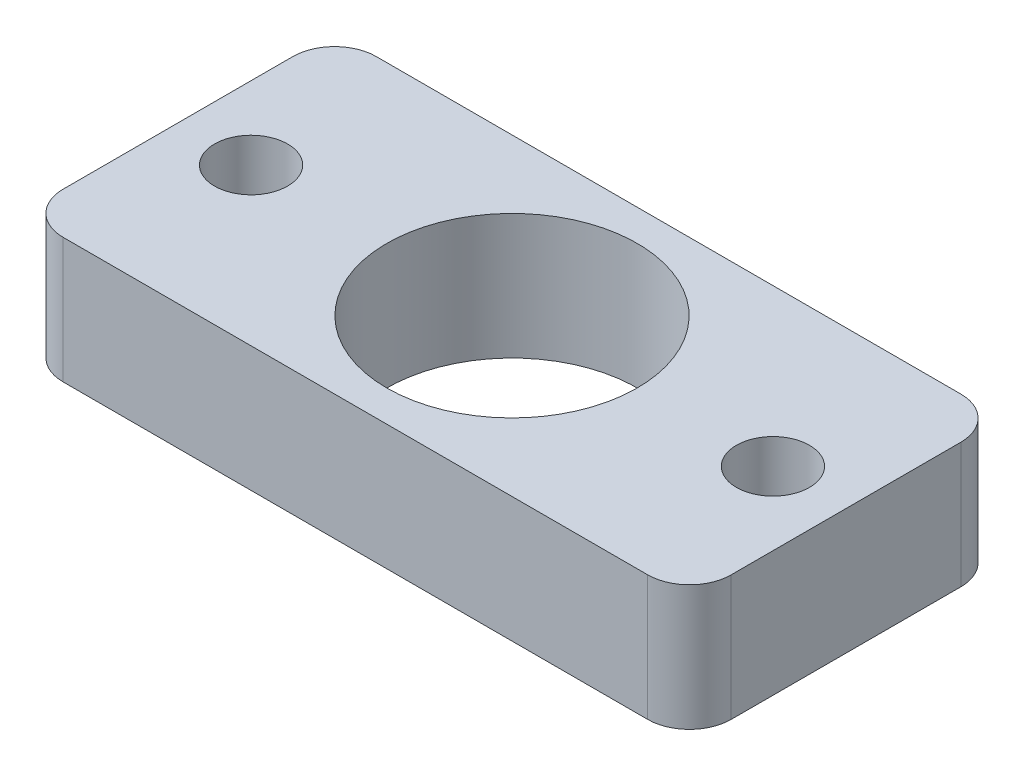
ISO-10303-21;
HEADER;
FILE_DESCRIPTION(('STEP AP214'),'2;1');
FILE_NAME('part.step','',(''),(''),'','','');
FILE_SCHEMA(('AUTOMOTIVE_DESIGN { 1 0 10303 214 1 1 1 1 }'));
ENDSEC;
DATA;
#1=APPLICATION_CONTEXT('core data for automotive mechanical design processes');
#2=APPLICATION_PROTOCOL_DEFINITION('international standard','automotive_design',2000,#1);
#3=PRODUCT_CONTEXT('',#1,'mechanical');
#4=PRODUCT('Part','Part','',(#3));
#5=PRODUCT_RELATED_PRODUCT_CATEGORY('part','',(#4));
#6=PRODUCT_DEFINITION_FORMATION('','',#4);
#7=PRODUCT_DEFINITION_CONTEXT('part definition',#1,'design');
#8=PRODUCT_DEFINITION('design','',#6,#7);
#9=PRODUCT_DEFINITION_SHAPE('','',#8);
#10=(LENGTH_UNIT() NAMED_UNIT(*) SI_UNIT(.MILLI.,.METRE.));
#11=(NAMED_UNIT(*) PLANE_ANGLE_UNIT() SI_UNIT($,.RADIAN.));
#12=(NAMED_UNIT(*) SI_UNIT($,.STERADIAN.) SOLID_ANGLE_UNIT());
#13=UNCERTAINTY_MEASURE_WITH_UNIT(LENGTH_MEASURE(1.E-05),#10,'distance_accuracy_value','');
#14=(GEOMETRIC_REPRESENTATION_CONTEXT(3) GLOBAL_UNCERTAINTY_ASSIGNED_CONTEXT((#13)) GLOBAL_UNIT_ASSIGNED_CONTEXT((#10,
#11,#12)) REPRESENTATION_CONTEXT('',''));
#15=CARTESIAN_POINT('',(0.,0.,0.));
#16=DIRECTION('',(0.,0.,1.));
#17=DIRECTION('',(1.,0.,0.));
#18=AXIS2_PLACEMENT_3D('',#15,#16,#17);
#19=CARTESIAN_POINT('',(16.,-3.,-7.5));
#20=DIRECTION('',(0.,0.,1.));
#21=DIRECTION('',(1.,0.,0.));
#22=AXIS2_PLACEMENT_3D('',#19,#20,#21);
#23=PLANE('',#22);
#24=DIRECTION('',(-1.,0.,0.));
#25=VECTOR('',#24,1.);
#26=CARTESIAN_POINT('',(16.,-3.,-7.5));
#27=LINE('',#26,#25);
#28=CARTESIAN_POINT('',(14.,-3.,-7.5));
#29=VERTEX_POINT('',#28);
#30=CARTESIAN_POINT('',(-14.,-3.,-7.5));
#31=VERTEX_POINT('',#30);
#32=EDGE_CURVE('E148',#29,#31,#27,.T.);
#33=ORIENTED_EDGE('',*,*,#32,.T.);
#34=DIRECTION('',(0.,1.,0.));
#35=VECTOR('',#34,1.);
#36=CARTESIAN_POINT('',(-14.,3.,-7.5));
#37=LINE('',#36,#35);
#38=CARTESIAN_POINT('',(-14.,3.,-7.5));
#39=VERTEX_POINT('',#38);
#40=EDGE_CURVE('E110',#31,#39,#37,.T.);
#41=ORIENTED_EDGE('',*,*,#40,.T.);
#42=DIRECTION('',(-1.,0.,0.));
#43=VECTOR('',#42,1.);
#44=CARTESIAN_POINT('',(16.,3.,-7.5));
#45=LINE('',#44,#43);
#46=CARTESIAN_POINT('',(14.,3.,-7.5));
#47=VERTEX_POINT('',#46);
#48=EDGE_CURVE('E102',#47,#39,#45,.T.);
#49=ORIENTED_EDGE('',*,*,#48,.F.);
#50=DIRECTION('',(0.,1.,0.));
#51=VECTOR('',#50,1.);
#52=CARTESIAN_POINT('',(14.,-3.,-7.5));
#53=LINE('',#52,#51);
#54=EDGE_CURVE('E115',#47,#29,#53,.F.);
#55=ORIENTED_EDGE('',*,*,#54,.T.);
#56=EDGE_LOOP('',(#33,#41,#49,#55));
#57=FACE_BOUND('',#56,.T.);
#58=ADVANCED_FACE('F32',(#57),#23,.F.);
#59=CARTESIAN_POINT('',(16.,3.,7.5));
#60=DIRECTION('',(0.,-1.,0.));
#61=DIRECTION('',(0.,0.,-1.));
#62=AXIS2_PLACEMENT_3D('',#59,#60,#61);
#63=PLANE('',#62);
#64=CARTESIAN_POINT('',(-12.5,3.,0.));
#65=DIRECTION('',(0.,1.,0.));
#66=DIRECTION('',(0.,0.,1.));
#67=AXIS2_PLACEMENT_3D('',#64,#65,#66);
#68=CIRCLE('',#67,1.74999999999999);
#69=CARTESIAN_POINT('',(-12.5,3.,1.74999999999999));
#70=VERTEX_POINT('',#69);
#71=EDGE_CURVE('E311',#70,#70,#68,.T.);
#72=ORIENTED_EDGE('',*,*,#71,.F.);
#73=EDGE_LOOP('',(#72));
#74=FACE_BOUND('',#73,.T.);
#75=CARTESIAN_POINT('',(12.5,3.,0.));
#76=DIRECTION('',(0.,1.,0.));
#77=DIRECTION('',(0.,0.,1.));
#78=AXIS2_PLACEMENT_3D('',#75,#76,#77);
#79=CIRCLE('',#78,1.74999999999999);
#80=CARTESIAN_POINT('',(12.5,3.,1.74999999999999));
#81=VERTEX_POINT('',#80);
#82=EDGE_CURVE('E307',#81,#81,#79,.T.);
#83=ORIENTED_EDGE('',*,*,#82,.F.);
#84=EDGE_LOOP('',(#83));
#85=FACE_BOUND('',#84,.T.);
#86=CARTESIAN_POINT('',(0.,3.,0.));
#87=DIRECTION('',(0.,1.,0.));
#88=DIRECTION('',(0.,0.,1.));
#89=AXIS2_PLACEMENT_3D('',#86,#87,#88);
#90=CIRCLE('',#89,6.);
#91=CARTESIAN_POINT('',(0.,3.,6.));
#92=VERTEX_POINT('',#91);
#93=EDGE_CURVE('E302',#92,#92,#90,.T.);
#94=ORIENTED_EDGE('',*,*,#93,.F.);
#95=EDGE_LOOP('',(#94));
#96=FACE_BOUND('',#95,.T.);
#97=ORIENTED_EDGE('',*,*,#48,.T.);
#98=CARTESIAN_POINT('',(-14.,3.,-5.5));
#99=DIRECTION('',(0.,-1.,0.));
#100=DIRECTION('',(0.,0.,-1.));
#101=AXIS2_PLACEMENT_3D('',#98,#99,#100);
#102=CIRCLE('',#101,2.);
#103=CARTESIAN_POINT('',(-16.,3.,-5.5));
#104=VERTEX_POINT('',#103);
#105=EDGE_CURVE('E129',#39,#104,#102,.F.);
#106=ORIENTED_EDGE('',*,*,#105,.T.);
#107=DIRECTION('',(0.,0.,1.));
#108=VECTOR('',#107,1.);
#109=CARTESIAN_POINT('',(-16.,3.,7.5));
#110=LINE('',#109,#108);
#111=CARTESIAN_POINT('',(-16.,3.,5.5));
#112=VERTEX_POINT('',#111);
#113=EDGE_CURVE('E156',#104,#112,#110,.T.);
#114=ORIENTED_EDGE('',*,*,#113,.T.);
#115=CARTESIAN_POINT('',(-14.,3.,5.5));
#116=DIRECTION('',(0.,-1.,0.));
#117=DIRECTION('',(0.,0.,-1.));
#118=AXIS2_PLACEMENT_3D('',#115,#116,#117);
#119=CIRCLE('',#118,2.);
#120=CARTESIAN_POINT('',(-14.,3.,7.5));
#121=VERTEX_POINT('',#120);
#122=EDGE_CURVE('E127',#112,#121,#119,.F.);
#123=ORIENTED_EDGE('',*,*,#122,.T.);
#124=DIRECTION('',(-1.,0.,0.));
#125=VECTOR('',#124,1.);
#126=CARTESIAN_POINT('',(16.,3.,7.5));
#127=LINE('',#126,#125);
#128=CARTESIAN_POINT('',(14.,3.,7.5));
#129=VERTEX_POINT('',#128);
#130=EDGE_CURVE('E118',#129,#121,#127,.T.);
#131=ORIENTED_EDGE('',*,*,#130,.F.);
#132=CARTESIAN_POINT('',(14.,3.,5.5));
#133=DIRECTION('',(0.,-1.,0.));
#134=DIRECTION('',(0.,0.,-1.));
#135=AXIS2_PLACEMENT_3D('',#132,#133,#134);
#136=CIRCLE('',#135,2.);
#137=CARTESIAN_POINT('',(16.,3.,5.5));
#138=VERTEX_POINT('',#137);
#139=EDGE_CURVE('E109',#129,#138,#136,.F.);
#140=ORIENTED_EDGE('',*,*,#139,.T.);
#141=DIRECTION('',(0.,0.,1.));
#142=VECTOR('',#141,1.);
#143=CARTESIAN_POINT('',(16.,3.,7.5));
#144=LINE('',#143,#142);
#145=CARTESIAN_POINT('',(16.,3.,-5.5));
#146=VERTEX_POINT('',#145);
#147=EDGE_CURVE('E104',#146,#138,#144,.T.);
#148=ORIENTED_EDGE('',*,*,#147,.F.);
#149=CARTESIAN_POINT('',(14.,3.,-5.5));
#150=DIRECTION('',(0.,-1.,0.));
#151=DIRECTION('',(0.,0.,-1.));
#152=AXIS2_PLACEMENT_3D('',#149,#150,#151);
#153=CIRCLE('',#152,2.);
#154=EDGE_CURVE('E99',#146,#47,#153,.F.);
#155=ORIENTED_EDGE('',*,*,#154,.T.);
#156=EDGE_LOOP('',(#97,#106,#114,#123,#131,#140,#148,#155));
#157=FACE_BOUND('',#156,.T.);
#158=ADVANCED_FACE('F101',(#74,#85,#96,#157),#63,.F.);
#159=CARTESIAN_POINT('',(16.,-3.,7.5));
#160=DIRECTION('',(0.,0.,-1.));
#161=DIRECTION('',(-1.,0.,0.));
#162=AXIS2_PLACEMENT_3D('',#159,#160,#161);
#163=PLANE('',#162);
#164=ORIENTED_EDGE('',*,*,#130,.T.);
#165=DIRECTION('',(0.,-1.,0.));
#166=VECTOR('',#165,1.);
#167=CARTESIAN_POINT('',(-14.,-3.,7.5));
#168=LINE('',#167,#166);
#169=CARTESIAN_POINT('',(-14.,-3.,7.5));
#170=VERTEX_POINT('',#169);
#171=EDGE_CURVE('E142',#121,#170,#168,.T.);
#172=ORIENTED_EDGE('',*,*,#171,.T.);
#173=DIRECTION('',(-1.,0.,0.));
#174=VECTOR('',#173,1.);
#175=CARTESIAN_POINT('',(16.,-3.,7.5));
#176=LINE('',#175,#174);
#177=CARTESIAN_POINT('',(14.,-3.,7.5));
#178=VERTEX_POINT('',#177);
#179=EDGE_CURVE('E150',#178,#170,#176,.T.);
#180=ORIENTED_EDGE('',*,*,#179,.F.);
#181=DIRECTION('',(0.,-1.,0.));
#182=VECTOR('',#181,1.);
#183=CARTESIAN_POINT('',(14.,-3.,7.5));
#184=LINE('',#183,#182);
#185=EDGE_CURVE('E140',#178,#129,#184,.F.);
#186=ORIENTED_EDGE('',*,*,#185,.T.);
#187=EDGE_LOOP('',(#164,#172,#180,#186));
#188=FACE_BOUND('',#187,.T.);
#189=ADVANCED_FACE('F165',(#188),#163,.F.);
#190=CARTESIAN_POINT('',(16.,-3.,7.5));
#191=DIRECTION('',(0.,1.,0.));
#192=DIRECTION('',(0.,0.,1.));
#193=AXIS2_PLACEMENT_3D('',#190,#191,#192);
#194=PLANE('',#193);
#195=CARTESIAN_POINT('',(-12.5,-3.,0.));
#196=DIRECTION('',(0.,1.,0.));
#197=DIRECTION('',(0.,0.,1.));
#198=AXIS2_PLACEMENT_3D('',#195,#196,#197);
#199=CIRCLE('',#198,1.75);
#200=CARTESIAN_POINT('',(-12.5,-3.,1.75));
#201=VERTEX_POINT('',#200);
#202=EDGE_CURVE('E295',#201,#201,#199,.T.);
#203=ORIENTED_EDGE('',*,*,#202,.T.);
#204=EDGE_LOOP('',(#203));
#205=FACE_BOUND('',#204,.T.);
#206=CARTESIAN_POINT('',(12.5,-3.,0.));
#207=DIRECTION('',(0.,1.,0.));
#208=DIRECTION('',(0.,0.,1.));
#209=AXIS2_PLACEMENT_3D('',#206,#207,#208);
#210=CIRCLE('',#209,1.75);
#211=CARTESIAN_POINT('',(12.5,-3.,1.75));
#212=VERTEX_POINT('',#211);
#213=EDGE_CURVE('E299',#212,#212,#210,.T.);
#214=ORIENTED_EDGE('',*,*,#213,.T.);
#215=EDGE_LOOP('',(#214));
#216=FACE_BOUND('',#215,.T.);
#217=CARTESIAN_POINT('',(0.,-3.,0.));
#218=DIRECTION('',(0.,1.,0.));
#219=DIRECTION('',(0.,0.,1.));
#220=AXIS2_PLACEMENT_3D('',#217,#218,#219);
#221=CIRCLE('',#220,6.);
#222=CARTESIAN_POINT('',(0.,-3.,6.));
#223=VERTEX_POINT('',#222);
#224=EDGE_CURVE('E159',#223,#223,#221,.T.);
#225=ORIENTED_EDGE('',*,*,#224,.T.);
#226=EDGE_LOOP('',(#225));
#227=FACE_BOUND('',#226,.T.);
#228=DIRECTION('',(0.,0.,-1.));
#229=VECTOR('',#228,1.);
#230=CARTESIAN_POINT('',(-16.,-3.,7.5));
#231=LINE('',#230,#229);
#232=CARTESIAN_POINT('',(-16.,-3.,5.5));
#233=VERTEX_POINT('',#232);
#234=CARTESIAN_POINT('',(-16.,-3.,-5.5));
#235=VERTEX_POINT('',#234);
#236=EDGE_CURVE('E152',#233,#235,#231,.T.);
#237=ORIENTED_EDGE('',*,*,#236,.T.);
#238=CARTESIAN_POINT('',(-14.,-3.,-5.5));
#239=DIRECTION('',(0.,1.,0.));
#240=DIRECTION('',(0.,0.,1.));
#241=AXIS2_PLACEMENT_3D('',#238,#239,#240);
#242=CIRCLE('',#241,2.);
#243=EDGE_CURVE('E138',#235,#31,#242,.F.);
#244=ORIENTED_EDGE('',*,*,#243,.T.);
#245=ORIENTED_EDGE('',*,*,#32,.F.);
#246=CARTESIAN_POINT('',(14.,-3.,-5.5));
#247=DIRECTION('',(0.,1.,0.));
#248=DIRECTION('',(0.,0.,1.));
#249=AXIS2_PLACEMENT_3D('',#246,#247,#248);
#250=CIRCLE('',#249,2.);
#251=CARTESIAN_POINT('',(16.,-3.,-5.5));
#252=VERTEX_POINT('',#251);
#253=EDGE_CURVE('E121',#29,#252,#250,.F.);
#254=ORIENTED_EDGE('',*,*,#253,.T.);
#255=DIRECTION('',(0.,0.,-1.));
#256=VECTOR('',#255,1.);
#257=CARTESIAN_POINT('',(16.,-3.,7.5));
#258=LINE('',#257,#256);
#259=CARTESIAN_POINT('',(16.,-3.,5.5));
#260=VERTEX_POINT('',#259);
#261=EDGE_CURVE('E147',#260,#252,#258,.T.);
#262=ORIENTED_EDGE('',*,*,#261,.F.);
#263=CARTESIAN_POINT('',(14.,-3.,5.5));
#264=DIRECTION('',(0.,1.,0.));
#265=DIRECTION('',(0.,0.,1.));
#266=AXIS2_PLACEMENT_3D('',#263,#264,#265);
#267=CIRCLE('',#266,2.);
#268=EDGE_CURVE('E55',#260,#178,#267,.F.);
#269=ORIENTED_EDGE('',*,*,#268,.T.);
#270=ORIENTED_EDGE('',*,*,#179,.T.);
#271=CARTESIAN_POINT('',(-14.,-3.,5.5));
#272=DIRECTION('',(0.,1.,0.));
#273=DIRECTION('',(0.,0.,1.));
#274=AXIS2_PLACEMENT_3D('',#271,#272,#273);
#275=CIRCLE('',#274,2.);
#276=EDGE_CURVE('E47',#170,#233,#275,.F.);
#277=ORIENTED_EDGE('',*,*,#276,.T.);
#278=EDGE_LOOP('',(#237,#244,#245,#254,#262,#269,#270,#277));
#279=FACE_BOUND('',#278,.T.);
#280=ADVANCED_FACE('F178',(#205,#216,#227,#279),#194,.F.);
#281=CARTESIAN_POINT('',(16.,0.,0.));
#282=DIRECTION('',(-1.,0.,0.));
#283=DIRECTION('',(0.,0.,1.));
#284=AXIS2_PLACEMENT_3D('',#281,#282,#283);
#285=PLANE('',#284);
#286=ORIENTED_EDGE('',*,*,#147,.T.);
#287=DIRECTION('',(0.,-1.,0.));
#288=VECTOR('',#287,1.);
#289=CARTESIAN_POINT('',(16.,0.,5.5));
#290=LINE('',#289,#288);
#291=EDGE_CURVE('E11',#138,#260,#290,.T.);
#292=ORIENTED_EDGE('',*,*,#291,.T.);
#293=ORIENTED_EDGE('',*,*,#261,.T.);
#294=DIRECTION('',(0.,1.,0.));
#295=VECTOR('',#294,1.);
#296=CARTESIAN_POINT('',(16.,0.,-5.5));
#297=LINE('',#296,#295);
#298=EDGE_CURVE('E40',#252,#146,#297,.T.);
#299=ORIENTED_EDGE('',*,*,#298,.T.);
#300=EDGE_LOOP('',(#286,#292,#293,#299));
#301=FACE_BOUND('',#300,.T.);
#302=ADVANCED_FACE('F145',(#301),#285,.F.);
#303=CARTESIAN_POINT('',(-16.,0.,0.));
#304=DIRECTION('',(-1.,0.,0.));
#305=DIRECTION('',(0.,0.,1.));
#306=AXIS2_PLACEMENT_3D('',#303,#304,#305);
#307=PLANE('',#306);
#308=ORIENTED_EDGE('',*,*,#113,.F.);
#309=DIRECTION('',(0.,1.,0.));
#310=VECTOR('',#309,1.);
#311=CARTESIAN_POINT('',(-16.,-3.,-5.5));
#312=LINE('',#311,#310);
#313=EDGE_CURVE('E133',#104,#235,#312,.F.);
#314=ORIENTED_EDGE('',*,*,#313,.T.);
#315=ORIENTED_EDGE('',*,*,#236,.F.);
#316=DIRECTION('',(0.,-1.,0.));
#317=VECTOR('',#316,1.);
#318=CARTESIAN_POINT('',(-16.,3.,5.5));
#319=LINE('',#318,#317);
#320=EDGE_CURVE('E131',#233,#112,#319,.F.);
#321=ORIENTED_EDGE('',*,*,#320,.T.);
#322=EDGE_LOOP('',(#308,#314,#315,#321));
#323=FACE_BOUND('',#322,.T.);
#324=ADVANCED_FACE('F173',(#323),#307,.T.);
#325=CARTESIAN_POINT('',(0.,-3.,0.));
#326=DIRECTION('',(0.,1.,0.));
#327=DIRECTION('',(0.,0.,1.));
#328=AXIS2_PLACEMENT_3D('',#325,#326,#327);
#329=CYLINDRICAL_SURFACE('',#328,6.);
#330=ORIENTED_EDGE('',*,*,#224,.F.);
#331=EDGE_LOOP('',(#330));
#332=FACE_BOUND('',#331,.T.);
#333=ORIENTED_EDGE('',*,*,#93,.T.);
#334=EDGE_LOOP('',(#333));
#335=FACE_BOUND('',#334,.T.);
#336=ADVANCED_FACE('F207',(#332,#335),#329,.F.);
#337=CARTESIAN_POINT('',(12.5,3.,0.));
#338=DIRECTION('',(0.,1.,0.));
#339=DIRECTION('',(0.,0.,1.));
#340=AXIS2_PLACEMENT_3D('',#337,#338,#339);
#341=CYLINDRICAL_SURFACE('',#340,1.74999999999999);
#342=ORIENTED_EDGE('',*,*,#213,.F.);
#343=EDGE_LOOP('',(#342));
#344=FACE_BOUND('',#343,.T.);
#345=ORIENTED_EDGE('',*,*,#82,.T.);
#346=EDGE_LOOP('',(#345));
#347=FACE_BOUND('',#346,.T.);
#348=ADVANCED_FACE('F201',(#344,#347),#341,.F.);
#349=CARTESIAN_POINT('',(-12.5,3.,0.));
#350=DIRECTION('',(0.,1.,0.));
#351=DIRECTION('',(0.,0.,1.));
#352=AXIS2_PLACEMENT_3D('',#349,#350,#351);
#353=CYLINDRICAL_SURFACE('',#352,1.74999999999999);
#354=ORIENTED_EDGE('',*,*,#202,.F.);
#355=EDGE_LOOP('',(#354));
#356=FACE_BOUND('',#355,.T.);
#357=ORIENTED_EDGE('',*,*,#71,.T.);
#358=EDGE_LOOP('',(#357));
#359=FACE_BOUND('',#358,.T.);
#360=ADVANCED_FACE('F197',(#356,#359),#353,.F.);
#361=CARTESIAN_POINT('',(-14.,-3.,-5.5));
#362=DIRECTION('',(0.,-1.,0.));
#363=DIRECTION('',(0.,0.,-1.));
#364=AXIS2_PLACEMENT_3D('',#361,#362,#363);
#365=CYLINDRICAL_SURFACE('',#364,2.);
#366=ORIENTED_EDGE('',*,*,#243,.F.);
#367=ORIENTED_EDGE('',*,*,#313,.F.);
#368=ORIENTED_EDGE('',*,*,#105,.F.);
#369=ORIENTED_EDGE('',*,*,#40,.F.);
#370=EDGE_LOOP('',(#366,#367,#368,#369));
#371=FACE_BOUND('',#370,.T.);
#372=ADVANCED_FACE('F177',(#371),#365,.T.);
#373=CARTESIAN_POINT('',(-14.,-3.,5.5));
#374=DIRECTION('',(0.,1.,0.));
#375=DIRECTION('',(0.,0.,1.));
#376=AXIS2_PLACEMENT_3D('',#373,#374,#375);
#377=CYLINDRICAL_SURFACE('',#376,2.);
#378=ORIENTED_EDGE('',*,*,#122,.F.);
#379=ORIENTED_EDGE('',*,*,#320,.F.);
#380=ORIENTED_EDGE('',*,*,#276,.F.);
#381=ORIENTED_EDGE('',*,*,#171,.F.);
#382=EDGE_LOOP('',(#378,#379,#380,#381));
#383=FACE_BOUND('',#382,.T.);
#384=ADVANCED_FACE('F169',(#383),#377,.T.);
#385=CARTESIAN_POINT('',(14.,0.,5.5));
#386=DIRECTION('',(0.,-1.,0.));
#387=DIRECTION('',(0.,0.,-1.));
#388=AXIS2_PLACEMENT_3D('',#385,#386,#387);
#389=CYLINDRICAL_SURFACE('',#388,2.);
#390=ORIENTED_EDGE('',*,*,#139,.F.);
#391=ORIENTED_EDGE('',*,*,#185,.F.);
#392=ORIENTED_EDGE('',*,*,#268,.F.);
#393=ORIENTED_EDGE('',*,*,#291,.F.);
#394=EDGE_LOOP('',(#390,#391,#392,#393));
#395=FACE_BOUND('',#394,.T.);
#396=ADVANCED_FACE('F180',(#395),#389,.T.);
#397=CARTESIAN_POINT('',(14.,0.,-5.5));
#398=DIRECTION('',(0.,1.,0.));
#399=DIRECTION('',(0.,0.,1.));
#400=AXIS2_PLACEMENT_3D('',#397,#398,#399);
#401=CYLINDRICAL_SURFACE('',#400,2.);
#402=ORIENTED_EDGE('',*,*,#253,.F.);
#403=ORIENTED_EDGE('',*,*,#54,.F.);
#404=ORIENTED_EDGE('',*,*,#154,.F.);
#405=ORIENTED_EDGE('',*,*,#298,.F.);
#406=EDGE_LOOP('',(#402,#403,#404,#405));
#407=FACE_BOUND('',#406,.T.);
#408=ADVANCED_FACE('F34',(#407),#401,.T.);
#409=CLOSED_SHELL('',(#58,#158,#189,#280,#302,#324,#336,#348,#360,#372,#384,#396,#408));
#410=MANIFOLD_SOLID_BREP('B2',#409);
#411=ADVANCED_BREP_SHAPE_REPRESENTATION('',(#18,#410),#14);
#412=SHAPE_DEFINITION_REPRESENTATION(#9,#411);
ENDSEC;
END-ISO-10303-21;
